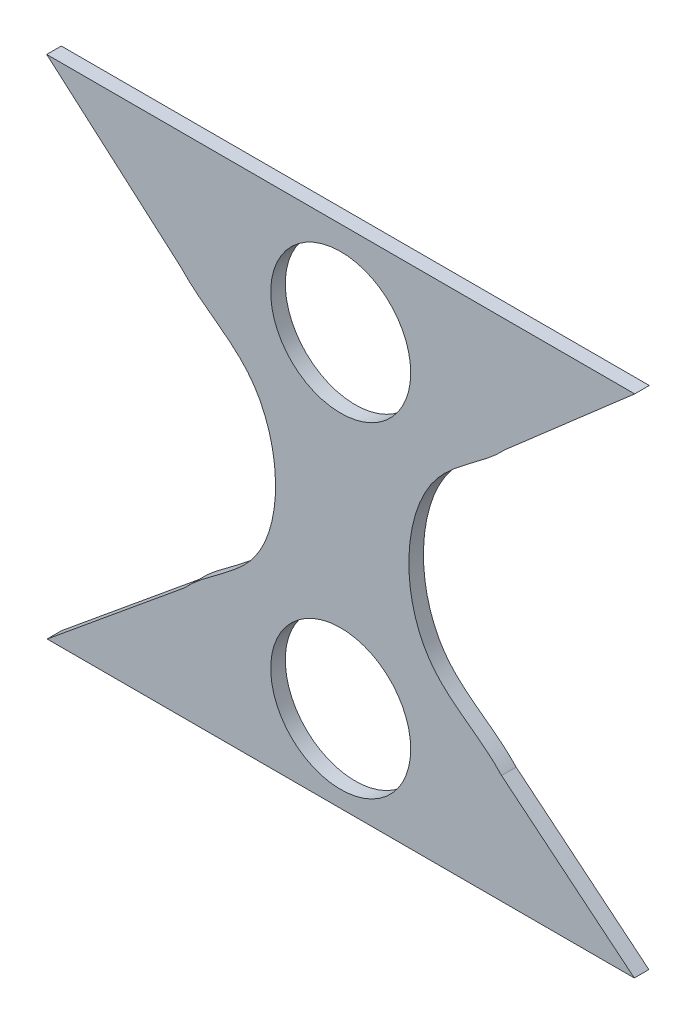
ISO-10303-21;
HEADER;
FILE_DESCRIPTION(('STEP AP214'),'2;1');
FILE_NAME('part.step','',(''),(''),'','','');
FILE_SCHEMA(('AUTOMOTIVE_DESIGN { 1 0 10303 214 1 1 1 1 }'));
ENDSEC;
DATA;
#1=APPLICATION_CONTEXT('core data for automotive mechanical design processes');
#2=APPLICATION_PROTOCOL_DEFINITION('international standard','automotive_design',2000,#1);
#3=PRODUCT_CONTEXT('',#1,'mechanical');
#4=PRODUCT('Part','Part','',(#3));
#5=PRODUCT_RELATED_PRODUCT_CATEGORY('part','',(#4));
#6=PRODUCT_DEFINITION_FORMATION('','',#4);
#7=PRODUCT_DEFINITION_CONTEXT('part definition',#1,'design');
#8=PRODUCT_DEFINITION('design','',#6,#7);
#9=PRODUCT_DEFINITION_SHAPE('','',#8);
#10=(LENGTH_UNIT() NAMED_UNIT(*) SI_UNIT(.MILLI.,.METRE.));
#11=(NAMED_UNIT(*) PLANE_ANGLE_UNIT() SI_UNIT($,.RADIAN.));
#12=(NAMED_UNIT(*) SI_UNIT($,.STERADIAN.) SOLID_ANGLE_UNIT());
#13=UNCERTAINTY_MEASURE_WITH_UNIT(LENGTH_MEASURE(1.E-05),#10,'distance_accuracy_value','');
#14=(GEOMETRIC_REPRESENTATION_CONTEXT(3) GLOBAL_UNCERTAINTY_ASSIGNED_CONTEXT((#13)) GLOBAL_UNIT_ASSIGNED_CONTEXT((#10,
#11,#12)) REPRESENTATION_CONTEXT('',''));
#15=CARTESIAN_POINT('',(0.,0.,0.));
#16=DIRECTION('',(0.,0.,1.));
#17=DIRECTION('',(1.,0.,0.));
#18=AXIS2_PLACEMENT_3D('',#15,#16,#17);
#19=CARTESIAN_POINT('',(140.793352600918,122.914831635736,-12.5));
#20=CARTESIAN_POINT('',(122.918741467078,103.647265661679,-12.5));
#21=CARTESIAN_POINT('',(53.5526824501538,71.2373649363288,-12.5));
#22=CARTESIAN_POINT('',(48.9581014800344,-68.6850792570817,-12.5));
#23=CARTESIAN_POINT('',(120.24622958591,-101.095183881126,-12.5));
#24=CARTESIAN_POINT('',(137.881648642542,-120.372867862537,-12.5));
#25=B_SPLINE_CURVE_WITH_KNOTS('',3,(#19,#20,#21,#22,#23,#24),.UNSPECIFIED.,.F.,.F.,(4,1,1,4),
(0.,0.264790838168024,0.735075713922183,1.),.UNSPECIFIED.);
#26=DIRECTION('',(0.,0.,1.));
#27=VECTOR('',#26,1.);
#28=SURFACE_OF_LINEAR_EXTRUSION('',#25,#27);
#29=CARTESIAN_POINT('',(140.793352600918,122.914831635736,0.));
#30=CARTESIAN_POINT('',(122.918741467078,103.647265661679,0.));
#31=CARTESIAN_POINT('',(53.5526824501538,71.2373649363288,0.));
#32=CARTESIAN_POINT('',(48.9581014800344,-68.6850792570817,0.));
#33=CARTESIAN_POINT('',(120.24622958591,-101.095183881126,0.));
#34=CARTESIAN_POINT('',(137.881648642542,-120.372867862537,0.));
#35=B_SPLINE_CURVE_WITH_KNOTS('',3,(#29,#30,#31,#32,#33,#34),.UNSPECIFIED.,.F.,.F.,(4,1,1,4),
(0.,0.264790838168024,0.735075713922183,1.),.UNSPECIFIED.);
#36=CARTESIAN_POINT('',(140.793352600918,122.914831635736,0.));
#37=VERTEX_POINT('',#36);
#38=CARTESIAN_POINT('',(137.881648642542,-120.372867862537,0.));
#39=VERTEX_POINT('',#38);
#40=EDGE_CURVE('E138',#37,#39,#35,.T.);
#41=ORIENTED_EDGE('',*,*,#40,.T.);
#42=DIRECTION('',(0.,0.,1.));
#43=VECTOR('',#42,1.);
#44=CARTESIAN_POINT('',(137.881648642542,-120.372867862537,-12.5));
#45=LINE('',#44,#43);
#46=CARTESIAN_POINT('',(137.881648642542,-120.372867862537,-12.5));
#47=VERTEX_POINT('',#46);
#48=EDGE_CURVE('E11',#47,#39,#45,.T.);
#49=ORIENTED_EDGE('',*,*,#48,.F.);
#50=CARTESIAN_POINT('',(140.793352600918,122.914831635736,-12.5));
#51=VERTEX_POINT('',#50);
#52=EDGE_CURVE('E54',#51,#47,#25,.T.);
#53=ORIENTED_EDGE('',*,*,#52,.F.);
#54=DIRECTION('',(0.,0.,1.));
#55=VECTOR('',#54,1.);
#56=CARTESIAN_POINT('',(140.793352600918,122.914831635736,-12.5));
#57=LINE('',#56,#55);
#58=EDGE_CURVE('E39',#51,#37,#57,.T.);
#59=ORIENTED_EDGE('',*,*,#58,.T.);
#60=EDGE_LOOP('',(#41,#49,#53,#59));
#61=FACE_BOUND('',#60,.T.);
#62=ADVANCED_FACE('F35',(#61),#28,.F.);
#63=CARTESIAN_POINT('',(-3.52830459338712,-4.29842589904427,-12.5));
#64=DIRECTION('',(0.63446609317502,0.772950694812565,0.));
#65=DIRECTION('',(-0.772950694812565,0.63446609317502,0.));
#66=AXIS2_PLACEMENT_3D('',#63,#64,#65);
#67=PLANE('',#66);
#68=DIRECTION('',(-0.772950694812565,0.63446609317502,0.));
#69=VECTOR('',#68,1.);
#70=CARTESIAN_POINT('',(-3.52830459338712,-4.29842589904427,0.));
#71=LINE('',#70,#69);
#72=CARTESIAN_POINT('',(251.640161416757,-213.75,0.));
#73=VERTEX_POINT('',#72);
#74=EDGE_CURVE('E164',#73,#39,#71,.T.);
#75=ORIENTED_EDGE('',*,*,#74,.F.);
#76=DIRECTION('',(0.,0.,1.));
#77=VECTOR('',#76,1.);
#78=CARTESIAN_POINT('',(251.640161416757,-213.75,-12.5));
#79=LINE('',#78,#77);
#80=CARTESIAN_POINT('',(251.640161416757,-213.75,-12.5));
#81=VERTEX_POINT('',#80);
#82=EDGE_CURVE('E45',#81,#73,#79,.T.);
#83=ORIENTED_EDGE('',*,*,#82,.F.);
#84=DIRECTION('',(-0.772950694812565,0.63446609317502,0.));
#85=VECTOR('',#84,1.);
#86=CARTESIAN_POINT('',(-3.52830459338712,-4.29842589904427,-12.5));
#87=LINE('',#86,#85);
#88=EDGE_CURVE('E127',#81,#47,#87,.T.);
#89=ORIENTED_EDGE('',*,*,#88,.T.);
#90=ORIENTED_EDGE('',*,*,#48,.T.);
#91=EDGE_LOOP('',(#75,#83,#89,#90));
#92=FACE_BOUND('',#91,.T.);
#93=ADVANCED_FACE('F202',(#92),#67,.T.);
#94=CARTESIAN_POINT('',(0.,-213.75,-12.5));
#95=DIRECTION('',(0.,-1.,0.));
#96=DIRECTION('',(1.,0.,0.));
#97=AXIS2_PLACEMENT_3D('',#94,#95,#96);
#98=PLANE('',#97);
#99=DIRECTION('',(1.,0.,0.));
#100=VECTOR('',#99,1.);
#101=CARTESIAN_POINT('',(0.,-213.75,0.));
#102=LINE('',#101,#100);
#103=CARTESIAN_POINT('',(-251.640883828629,-213.75,0.));
#104=VERTEX_POINT('',#103);
#105=EDGE_CURVE('E112',#104,#73,#102,.T.);
#106=ORIENTED_EDGE('',*,*,#105,.F.);
#107=DIRECTION('',(0.,0.,1.));
#108=VECTOR('',#107,1.);
#109=CARTESIAN_POINT('',(-251.640883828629,-213.75,-12.5));
#110=LINE('',#109,#108);
#111=CARTESIAN_POINT('',(-251.640883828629,-213.75,-12.5));
#112=VERTEX_POINT('',#111);
#113=EDGE_CURVE('E107',#112,#104,#110,.T.);
#114=ORIENTED_EDGE('',*,*,#113,.F.);
#115=DIRECTION('',(1.,0.,0.));
#116=VECTOR('',#115,1.);
#117=CARTESIAN_POINT('',(0.,-213.75,-12.5));
#118=LINE('',#117,#116);
#119=EDGE_CURVE('E111',#112,#81,#118,.T.);
#120=ORIENTED_EDGE('',*,*,#119,.T.);
#121=ORIENTED_EDGE('',*,*,#82,.T.);
#122=EDGE_LOOP('',(#106,#114,#120,#121));
#123=FACE_BOUND('',#122,.T.);
#124=ADVANCED_FACE('F109',(#123),#98,.T.);
#125=CARTESIAN_POINT('',(3.32553602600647,-4.04326554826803,-12.5));
#126=DIRECTION('',(0.635227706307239,-0.772324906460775,0.));
#127=DIRECTION('',(0.772324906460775,0.635227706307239,0.));
#128=AXIS2_PLACEMENT_3D('',#125,#126,#127);
#129=PLANE('',#128);
#130=DIRECTION('',(0.772324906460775,0.635227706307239,0.));
#131=VECTOR('',#130,1.);
#132=CARTESIAN_POINT('',(3.32553602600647,-4.04326554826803,0.));
#133=LINE('',#132,#131);
#134=CARTESIAN_POINT('',(-134.152341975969,-117.117123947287,0.));
#135=VERTEX_POINT('',#134);
#136=EDGE_CURVE('E158',#104,#135,#133,.T.);
#137=ORIENTED_EDGE('',*,*,#136,.T.);
#138=DIRECTION('',(0.,0.,1.));
#139=VECTOR('',#138,1.);
#140=CARTESIAN_POINT('',(-134.152341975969,-117.117123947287,-12.5));
#141=LINE('',#140,#139);
#142=CARTESIAN_POINT('',(-134.152341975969,-117.117123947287,-12.5));
#143=VERTEX_POINT('',#142);
#144=EDGE_CURVE('E116',#143,#135,#141,.T.);
#145=ORIENTED_EDGE('',*,*,#144,.F.);
#146=DIRECTION('',(0.772324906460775,0.635227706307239,0.));
#147=VECTOR('',#146,1.);
#148=CARTESIAN_POINT('',(3.32553602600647,-4.04326554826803,-12.5));
#149=LINE('',#148,#147);
#150=EDGE_CURVE('E119',#112,#143,#149,.T.);
#151=ORIENTED_EDGE('',*,*,#150,.F.);
#152=ORIENTED_EDGE('',*,*,#113,.T.);
#153=EDGE_LOOP('',(#137,#145,#151,#152));
#154=FACE_BOUND('',#153,.T.);
#155=ADVANCED_FACE('F120',(#154),#129,.F.);
#156=CARTESIAN_POINT('',(-136.985292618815,119.590334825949,-12.5));
#157=CARTESIAN_POINT('',(-119.17900971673,100.253738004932,-12.5));
#158=CARTESIAN_POINT('',(-51.3113887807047,69.2588540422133,-12.5));
#159=CARTESIAN_POINT('',(-46.8568915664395,-66.7959888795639,-12.5));
#160=CARTESIAN_POINT('',(-116.610031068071,-97.7906783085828,-12.5));
#161=CARTESIAN_POINT('',(-134.152341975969,-117.117123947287,-12.5));
#162=B_SPLINE_CURVE_WITH_KNOTS('',3,(#156,#157,#158,#159,#160,#161),.UNSPECIFIED.,.F.,.F.,(4,1,
1,4),(0.,0.270923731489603,0.729212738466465,1.),.UNSPECIFIED.);
#163=DIRECTION('',(0.,0.,1.));
#164=VECTOR('',#163,1.);
#165=SURFACE_OF_LINEAR_EXTRUSION('',#162,#164);
#166=CARTESIAN_POINT('',(-136.985292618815,119.590334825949,0.));
#167=CARTESIAN_POINT('',(-119.17900971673,100.253738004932,0.));
#168=CARTESIAN_POINT('',(-51.3113887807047,69.2588540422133,0.));
#169=CARTESIAN_POINT('',(-46.8568915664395,-66.7959888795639,0.));
#170=CARTESIAN_POINT('',(-116.610031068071,-97.7906783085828,0.));
#171=CARTESIAN_POINT('',(-134.152341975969,-117.117123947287,0.));
#172=B_SPLINE_CURVE_WITH_KNOTS('',3,(#166,#167,#168,#169,#170,#171),.UNSPECIFIED.,.F.,.F.,(4,1,
1,4),(0.,0.270923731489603,0.729212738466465,1.),.UNSPECIFIED.);
#173=CARTESIAN_POINT('',(-136.985292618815,119.590334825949,0.));
#174=VERTEX_POINT('',#173);
#175=EDGE_CURVE('E153',#174,#135,#172,.T.);
#176=ORIENTED_EDGE('',*,*,#175,.F.);
#177=DIRECTION('',(0.,0.,1.));
#178=VECTOR('',#177,1.);
#179=CARTESIAN_POINT('',(-136.985292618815,119.590334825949,-12.5));
#180=LINE('',#179,#178);
#181=CARTESIAN_POINT('',(-136.985292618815,119.590334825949,-12.5));
#182=VERTEX_POINT('',#181);
#183=EDGE_CURVE('E175',#182,#174,#180,.T.);
#184=ORIENTED_EDGE('',*,*,#183,.F.);
#185=EDGE_CURVE('E123',#182,#143,#162,.T.);
#186=ORIENTED_EDGE('',*,*,#185,.T.);
#187=ORIENTED_EDGE('',*,*,#144,.T.);
#188=EDGE_LOOP('',(#176,#184,#186,#187));
#189=FACE_BOUND('',#188,.T.);
#190=ADVANCED_FACE('F214',(#189),#165,.T.);
#191=CARTESIAN_POINT('',(0.,0.,-12.5));
#192=DIRECTION('',(0.657657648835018,0.753316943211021,0.));
#193=DIRECTION('',(-0.753316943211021,0.657657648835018,0.));
#194=AXIS2_PLACEMENT_3D('',#191,#192,#193);
#195=PLANE('',#194);
#196=DIRECTION('',(-0.753316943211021,0.657657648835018,0.));
#197=VECTOR('',#196,1.);
#198=CARTESIAN_POINT('',(0.,0.,0.));
#199=LINE('',#198,#197);
#200=CARTESIAN_POINT('',(-252.000000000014,220.000000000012,0.));
#201=VERTEX_POINT('',#200);
#202=EDGE_CURVE('E151',#174,#201,#199,.T.);
#203=ORIENTED_EDGE('',*,*,#202,.T.);
#204=DIRECTION('',(0.,0.,1.));
#205=VECTOR('',#204,1.);
#206=CARTESIAN_POINT('',(-252.000000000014,220.000000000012,-12.5));
#207=LINE('',#206,#205);
#208=CARTESIAN_POINT('',(-252.000000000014,220.000000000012,-12.5));
#209=VERTEX_POINT('',#208);
#210=EDGE_CURVE('E177',#209,#201,#207,.T.);
#211=ORIENTED_EDGE('',*,*,#210,.F.);
#212=DIRECTION('',(-0.753316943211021,0.657657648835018,0.));
#213=VECTOR('',#212,1.);
#214=CARTESIAN_POINT('',(0.,0.,-12.5));
#215=LINE('',#214,#213);
#216=EDGE_CURVE('E223',#182,#209,#215,.T.);
#217=ORIENTED_EDGE('',*,*,#216,.F.);
#218=ORIENTED_EDGE('',*,*,#183,.T.);
#219=EDGE_LOOP('',(#203,#211,#217,#218));
#220=FACE_BOUND('',#219,.T.);
#221=ADVANCED_FACE('F217',(#220),#195,.F.);
#222=CARTESIAN_POINT('',(0.,220.000000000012,-12.5));
#223=DIRECTION('',(0.,-1.,0.));
#224=DIRECTION('',(0.,0.,-1.));
#225=AXIS2_PLACEMENT_3D('',#222,#223,#224);
#226=PLANE('',#225);
#227=DIRECTION('',(1.,0.,0.));
#228=VECTOR('',#227,1.);
#229=CARTESIAN_POINT('',(0.,220.000000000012,0.));
#230=LINE('',#229,#228);
#231=CARTESIAN_POINT('',(251.999999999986,220.000000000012,0.));
#232=VERTEX_POINT('',#231);
#233=EDGE_CURVE('E148',#201,#232,#230,.T.);
#234=ORIENTED_EDGE('',*,*,#233,.T.);
#235=DIRECTION('',(0.,0.,1.));
#236=VECTOR('',#235,1.);
#237=CARTESIAN_POINT('',(251.999999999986,220.000000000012,-12.5));
#238=LINE('',#237,#236);
#239=CARTESIAN_POINT('',(251.999999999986,220.000000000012,-12.5));
#240=VERTEX_POINT('',#239);
#241=EDGE_CURVE('E179',#240,#232,#238,.T.);
#242=ORIENTED_EDGE('',*,*,#241,.F.);
#243=DIRECTION('',(1.,0.,0.));
#244=VECTOR('',#243,1.);
#245=CARTESIAN_POINT('',(0.,220.000000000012,-12.5));
#246=LINE('',#245,#244);
#247=EDGE_CURVE('E228',#209,#240,#246,.T.);
#248=ORIENTED_EDGE('',*,*,#247,.F.);
#249=ORIENTED_EDGE('',*,*,#210,.T.);
#250=EDGE_LOOP('',(#234,#242,#248,#249));
#251=FACE_BOUND('',#250,.T.);
#252=ADVANCED_FACE('F197',(#251),#226,.F.);
#253=CARTESIAN_POINT('',(0.,139.650441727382,-12.5));
#254=DIRECTION('',(0.,0.,1.));
#255=DIRECTION('',(1.,0.,0.));
#256=AXIS2_PLACEMENT_3D('',#253,#254,#255);
#257=CYLINDRICAL_SURFACE('',#256,60.);
#258=CARTESIAN_POINT('',(0.,139.650441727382,-12.5));
#259=DIRECTION('',(0.,0.,1.));
#260=DIRECTION('',(1.,0.,0.));
#261=AXIS2_PLACEMENT_3D('',#258,#259,#260);
#262=CIRCLE('',#261,60.);
#263=CARTESIAN_POINT('',(60.,139.650441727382,-12.5));
#264=VERTEX_POINT('',#263);
#265=EDGE_CURVE('E129',#264,#264,#262,.T.);
#266=ORIENTED_EDGE('',*,*,#265,.F.);
#267=EDGE_LOOP('',(#266));
#268=FACE_BOUND('',#267,.T.);
#269=CARTESIAN_POINT('',(0.,139.650441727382,0.));
#270=DIRECTION('',(0.,0.,1.));
#271=DIRECTION('',(1.,0.,0.));
#272=AXIS2_PLACEMENT_3D('',#269,#270,#271);
#273=CIRCLE('',#272,60.);
#274=CARTESIAN_POINT('',(60.,139.650441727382,0.));
#275=VERTEX_POINT('',#274);
#276=EDGE_CURVE('E167',#275,#275,#273,.T.);
#277=ORIENTED_EDGE('',*,*,#276,.T.);
#278=EDGE_LOOP('',(#277));
#279=FACE_BOUND('',#278,.T.);
#280=ADVANCED_FACE('F190',(#268,#279),#257,.F.);
#281=CARTESIAN_POINT('',(-1.09521999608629E-13,1.25452472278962E-13,-12.5));
#282=DIRECTION('',(0.657657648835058,-0.753316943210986,0.));
#283=DIRECTION('',(0.753316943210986,0.657657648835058,0.));
#284=AXIS2_PLACEMENT_3D('',#281,#282,#283);
#285=PLANE('',#284);
#286=DIRECTION('',(0.753316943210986,0.657657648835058,0.));
#287=VECTOR('',#286,1.);
#288=CARTESIAN_POINT('',(-1.09521999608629E-13,1.25452472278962E-13,0.));
#289=LINE('',#288,#287);
#290=EDGE_CURVE('E142',#37,#232,#289,.T.);
#291=ORIENTED_EDGE('',*,*,#290,.F.);
#292=ORIENTED_EDGE('',*,*,#58,.F.);
#293=DIRECTION('',(0.753316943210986,0.657657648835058,0.));
#294=VECTOR('',#293,1.);
#295=CARTESIAN_POINT('',(-1.09521999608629E-13,1.25452472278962E-13,-12.5));
#296=LINE('',#295,#294);
#297=EDGE_CURVE('E230',#51,#240,#296,.T.);
#298=ORIENTED_EDGE('',*,*,#297,.T.);
#299=ORIENTED_EDGE('',*,*,#241,.T.);
#300=EDGE_LOOP('',(#291,#292,#298,#299));
#301=FACE_BOUND('',#300,.T.);
#302=ADVANCED_FACE('F187',(#301),#285,.T.);
#303=CARTESIAN_POINT('',(0.,-139.650441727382,-12.5));
#304=DIRECTION('',(0.,0.,1.));
#305=DIRECTION('',(1.,0.,0.));
#306=AXIS2_PLACEMENT_3D('',#303,#304,#305);
#307=CYLINDRICAL_SURFACE('',#306,60.);
#308=CARTESIAN_POINT('',(0.,-139.650441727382,-12.5));
#309=DIRECTION('',(0.,0.,1.));
#310=DIRECTION('',(1.,0.,0.));
#311=AXIS2_PLACEMENT_3D('',#308,#309,#310);
#312=CIRCLE('',#311,60.);
#313=CARTESIAN_POINT('',(60.,-139.650441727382,-12.5));
#314=VERTEX_POINT('',#313);
#315=EDGE_CURVE('E135',#314,#314,#312,.F.);
#316=ORIENTED_EDGE('',*,*,#315,.T.);
#317=EDGE_LOOP('',(#316));
#318=FACE_BOUND('',#317,.T.);
#319=CARTESIAN_POINT('',(0.,-139.650441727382,0.));
#320=DIRECTION('',(0.,0.,1.));
#321=DIRECTION('',(1.,0.,0.));
#322=AXIS2_PLACEMENT_3D('',#319,#320,#321);
#323=CIRCLE('',#322,60.);
#324=CARTESIAN_POINT('',(60.,-139.650441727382,0.));
#325=VERTEX_POINT('',#324);
#326=EDGE_CURVE('E170',#325,#325,#323,.F.);
#327=ORIENTED_EDGE('',*,*,#326,.F.);
#328=EDGE_LOOP('',(#327));
#329=FACE_BOUND('',#328,.T.);
#330=ADVANCED_FACE('F189',(#318,#329),#307,.F.);
#331=CARTESIAN_POINT('',(0.,0.,-12.5));
#332=DIRECTION('',(0.,0.,1.));
#333=DIRECTION('',(1.,0.,0.));
#334=AXIS2_PLACEMENT_3D('',#331,#332,#333);
#335=PLANE('',#334);
#336=ORIENTED_EDGE('',*,*,#52,.T.);
#337=ORIENTED_EDGE('',*,*,#88,.F.);
#338=ORIENTED_EDGE('',*,*,#119,.F.);
#339=ORIENTED_EDGE('',*,*,#150,.T.);
#340=ORIENTED_EDGE('',*,*,#185,.F.);
#341=ORIENTED_EDGE('',*,*,#216,.T.);
#342=ORIENTED_EDGE('',*,*,#247,.T.);
#343=ORIENTED_EDGE('',*,*,#297,.F.);
#344=EDGE_LOOP('',(#336,#337,#338,#339,#340,#341,#342,#343));
#345=FACE_BOUND('',#344,.T.);
#346=ORIENTED_EDGE('',*,*,#265,.T.);
#347=EDGE_LOOP('',(#346));
#348=FACE_BOUND('',#347,.T.);
#349=ORIENTED_EDGE('',*,*,#315,.F.);
#350=EDGE_LOOP('',(#349));
#351=FACE_BOUND('',#350,.T.);
#352=ADVANCED_FACE('F125',(#345,#348,#351),#335,.F.);
#353=CARTESIAN_POINT('',(0.,0.,0.));
#354=DIRECTION('',(0.,0.,1.));
#355=DIRECTION('',(1.,0.,0.));
#356=AXIS2_PLACEMENT_3D('',#353,#354,#355);
#357=PLANE('',#356);
#358=ORIENTED_EDGE('',*,*,#40,.F.);
#359=ORIENTED_EDGE('',*,*,#290,.T.);
#360=ORIENTED_EDGE('',*,*,#233,.F.);
#361=ORIENTED_EDGE('',*,*,#202,.F.);
#362=ORIENTED_EDGE('',*,*,#175,.T.);
#363=ORIENTED_EDGE('',*,*,#136,.F.);
#364=ORIENTED_EDGE('',*,*,#105,.T.);
#365=ORIENTED_EDGE('',*,*,#74,.T.);
#366=EDGE_LOOP('',(#358,#359,#360,#361,#362,#363,#364,#365));
#367=FACE_BOUND('',#366,.T.);
#368=ORIENTED_EDGE('',*,*,#276,.F.);
#369=EDGE_LOOP('',(#368));
#370=FACE_BOUND('',#369,.T.);
#371=ORIENTED_EDGE('',*,*,#326,.T.);
#372=EDGE_LOOP('',(#371));
#373=FACE_BOUND('',#372,.T.);
#374=ADVANCED_FACE('F184',(#367,#370,#373),#357,.T.);
#375=CLOSED_SHELL('',(#62,#93,#124,#155,#190,#221,#252,#280,#302,#330,#352,#374));
#376=MANIFOLD_SOLID_BREP('B2',#375);
#377=ADVANCED_BREP_SHAPE_REPRESENTATION('',(#18,#376),#14);
#378=SHAPE_DEFINITION_REPRESENTATION(#9,#377);
ENDSEC;
END-ISO-10303-21;
